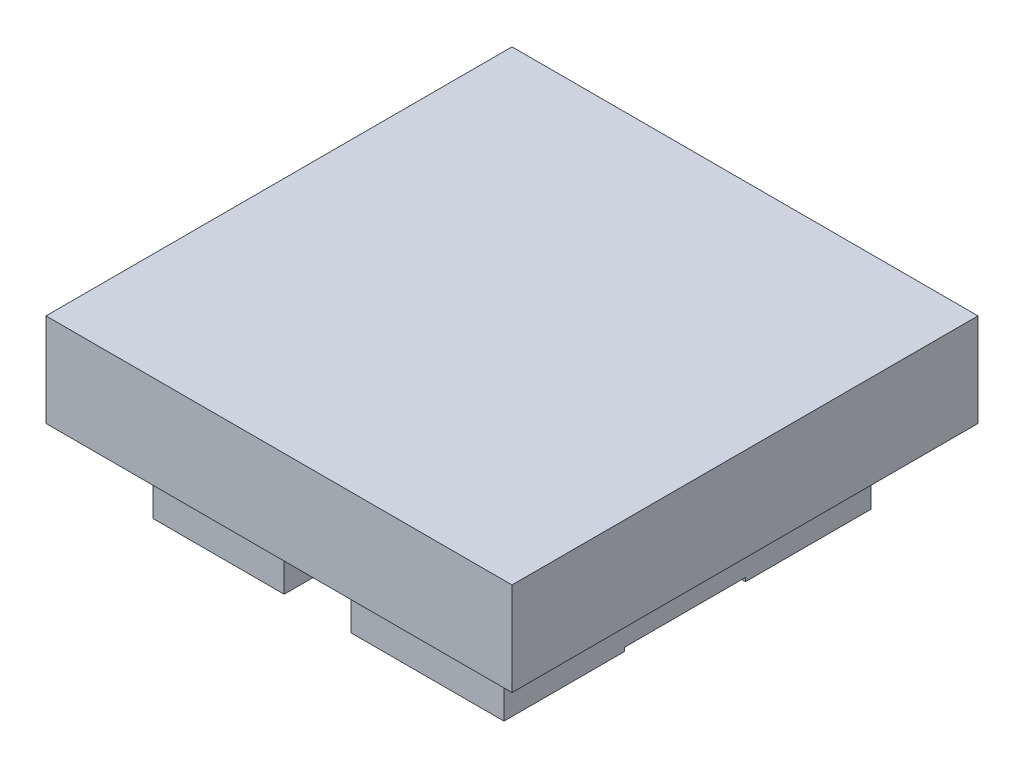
ISO-10303-21;
HEADER;
FILE_DESCRIPTION(('STEP AP214'),'2;1');
FILE_NAME('part.step','',(''),(''),'','','');
FILE_SCHEMA(('AUTOMOTIVE_DESIGN { 1 0 10303 214 1 1 1 1 }'));
ENDSEC;
DATA;
#1=APPLICATION_CONTEXT('core data for automotive mechanical design processes');
#2=APPLICATION_PROTOCOL_DEFINITION('international standard','automotive_design',2000,#1);
#3=PRODUCT_CONTEXT('',#1,'mechanical');
#4=PRODUCT('Part','Part','',(#3));
#5=PRODUCT_RELATED_PRODUCT_CATEGORY('part','',(#4));
#6=PRODUCT_DEFINITION_FORMATION('','',#4);
#7=PRODUCT_DEFINITION_CONTEXT('part definition',#1,'design');
#8=PRODUCT_DEFINITION('design','',#6,#7);
#9=PRODUCT_DEFINITION_SHAPE('','',#8);
#10=(LENGTH_UNIT() NAMED_UNIT(*) SI_UNIT(.MILLI.,.METRE.));
#11=(NAMED_UNIT(*) PLANE_ANGLE_UNIT() SI_UNIT($,.RADIAN.));
#12=(NAMED_UNIT(*) SI_UNIT($,.STERADIAN.) SOLID_ANGLE_UNIT());
#13=UNCERTAINTY_MEASURE_WITH_UNIT(LENGTH_MEASURE(1.E-05),#10,'distance_accuracy_value','');
#14=(GEOMETRIC_REPRESENTATION_CONTEXT(3) GLOBAL_UNCERTAINTY_ASSIGNED_CONTEXT((#13)) GLOBAL_UNIT_ASSIGNED_CONTEXT((#10,
#11,#12)) REPRESENTATION_CONTEXT('',''));
#15=CARTESIAN_POINT('',(0.,0.,0.));
#16=DIRECTION('',(0.,0.,1.));
#17=DIRECTION('',(1.,0.,0.));
#18=AXIS2_PLACEMENT_3D('',#15,#16,#17);
#19=CARTESIAN_POINT('',(0.,-40.,0.));
#20=DIRECTION('',(0.,-1.,0.));
#21=DIRECTION('',(0.,0.,-1.));
#22=AXIS2_PLACEMENT_3D('',#19,#20,#21);
#23=PLANE('',#22);
#24=DIRECTION('',(-1.,0.,0.));
#25=VECTOR('',#24,1.);
#26=CARTESIAN_POINT('',(-73.882719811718,-40.,160.677434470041));
#27=LINE('',#26,#25);
#28=CARTESIAN_POINT('',(103.239295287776,-40.,160.677434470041));
#29=VERTEX_POINT('',#28);
#30=CARTESIAN_POINT('',(32.8965521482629,-40.,160.677434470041));
#31=VERTEX_POINT('',#30);
#32=EDGE_CURVE('E358',#29,#31,#27,.T.);
#33=ORIENTED_EDGE('',*,*,#32,.F.);
#34=DIRECTION('',(0.,0.,1.));
#35=VECTOR('',#34,1.);
#36=CARTESIAN_POINT('',(103.239295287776,-40.,225.453485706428));
#37=LINE('',#36,#35);
#38=CARTESIAN_POINT('',(103.239295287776,-40.,225.453485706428));
#39=VERTEX_POINT('',#38);
#40=EDGE_CURVE('E438',#29,#39,#37,.T.);
#41=ORIENTED_EDGE('',*,*,#40,.T.);
#42=DIRECTION('',(-1.,0.,0.));
#43=VECTOR('',#42,1.);
#44=CARTESIAN_POINT('',(32.8965521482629,-40.,225.453485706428));
#45=LINE('',#44,#43);
#46=CARTESIAN_POINT('',(32.8965521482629,-40.,225.453485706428));
#47=VERTEX_POINT('',#46);
#48=EDGE_CURVE('E442',#39,#47,#45,.T.);
#49=ORIENTED_EDGE('',*,*,#48,.T.);
#50=DIRECTION('',(0.,0.,-1.));
#51=VECTOR('',#50,1.);
#52=CARTESIAN_POINT('',(32.8965521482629,-40.,225.453485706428));
#53=LINE('',#52,#51);
#54=EDGE_CURVE('E432',#47,#31,#53,.T.);
#55=ORIENTED_EDGE('',*,*,#54,.T.);
#56=EDGE_LOOP('',(#33,#41,#49,#55));
#57=FACE_BOUND('',#56,.T.);
#58=ADVANCED_FACE('F33',(#57),#23,.T.);
#59=CARTESIAN_POINT('',(0.,-40.,0.));
#60=DIRECTION('',(0.,-1.,0.));
#61=DIRECTION('',(0.,0.,-1.));
#62=AXIS2_PLACEMENT_3D('',#59,#60,#61);
#63=PLANE('',#62);
#64=DIRECTION('',(0.,0.,-1.));
#65=VECTOR('',#64,1.);
#66=CARTESIAN_POINT('',(151.315270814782,-40.,0.));
#67=LINE('',#66,#65);
#68=CARTESIAN_POINT('',(151.315270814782,-40.,211.789787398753));
#69=VERTEX_POINT('',#68);
#70=CARTESIAN_POINT('',(151.315270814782,-40.,171.304755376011));
#71=VERTEX_POINT('',#70);
#72=EDGE_CURVE('E512',#69,#71,#67,.T.);
#73=ORIENTED_EDGE('',*,*,#72,.F.);
#74=DIRECTION('',(-1.,0.,0.));
#75=VECTOR('',#74,1.);
#76=CARTESIAN_POINT('',(0.,-40.,211.789787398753));
#77=LINE('',#76,#75);
#78=CARTESIAN_POINT('',(209.512504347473,-40.,211.789787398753));
#79=VERTEX_POINT('',#78);
#80=EDGE_CURVE('E509',#79,#69,#77,.T.);
#81=ORIENTED_EDGE('',*,*,#80,.F.);
#82=DIRECTION('',(0.,0.,1.));
#83=VECTOR('',#82,1.);
#84=CARTESIAN_POINT('',(209.512504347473,-40.,0.));
#85=LINE('',#84,#83);
#86=CARTESIAN_POINT('',(209.512504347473,-40.,171.304755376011));
#87=VERTEX_POINT('',#86);
#88=EDGE_CURVE('E506',#87,#79,#85,.T.);
#89=ORIENTED_EDGE('',*,*,#88,.F.);
#90=DIRECTION('',(1.,0.,0.));
#91=VECTOR('',#90,1.);
#92=CARTESIAN_POINT('',(0.,-40.,171.304755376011));
#93=LINE('',#92,#91);
#94=EDGE_CURVE('E503',#71,#87,#93,.T.);
#95=ORIENTED_EDGE('',*,*,#94,.F.);
#96=EDGE_LOOP('',(#73,#81,#89,#95));
#97=FACE_BOUND('',#96,.T.);
#98=DIRECTION('',(-1.,0.,0.));
#99=VECTOR('',#98,1.);
#100=CARTESIAN_POINT('',(0.,-40.,160.677434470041));
#101=LINE('',#100,#99);
#102=CARTESIAN_POINT('',(221.151951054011,-40.,160.677434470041));
#103=VERTEX_POINT('',#102);
#104=CARTESIAN_POINT('',(139.16976120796,-40.,160.677434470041));
#105=VERTEX_POINT('',#104);
#106=EDGE_CURVE('E499',#103,#105,#101,.T.);
#107=ORIENTED_EDGE('',*,*,#106,.F.);
#108=DIRECTION('',(0.,0.,1.));
#109=VECTOR('',#108,1.);
#110=CARTESIAN_POINT('',(221.151951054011,-40.,225.453485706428));
#111=LINE('',#110,#109);
#112=CARTESIAN_POINT('',(221.151951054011,-40.,225.453485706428));
#113=VERTEX_POINT('',#112);
#114=EDGE_CURVE('E402',#103,#113,#111,.T.);
#115=ORIENTED_EDGE('',*,*,#114,.T.);
#116=DIRECTION('',(-1.,0.,0.));
#117=VECTOR('',#116,1.);
#118=CARTESIAN_POINT('',(139.16976120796,-40.,225.453485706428));
#119=LINE('',#118,#117);
#120=CARTESIAN_POINT('',(139.16976120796,-40.,225.453485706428));
#121=VERTEX_POINT('',#120);
#122=EDGE_CURVE('E406',#113,#121,#119,.T.);
#123=ORIENTED_EDGE('',*,*,#122,.T.);
#124=DIRECTION('',(0.,0.,-1.));
#125=VECTOR('',#124,1.);
#126=CARTESIAN_POINT('',(139.16976120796,-40.,225.453485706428));
#127=LINE('',#126,#125);
#128=EDGE_CURVE('E396',#121,#105,#127,.T.);
#129=ORIENTED_EDGE('',*,*,#128,.T.);
#130=EDGE_LOOP('',(#107,#115,#123,#129));
#131=FACE_BOUND('',#130,.T.);
#132=ADVANCED_FACE('F589',(#97,#131),#63,.T.);
#133=CARTESIAN_POINT('',(0.,0.,250.));
#134=DIRECTION('',(0.,1.,0.));
#135=DIRECTION('',(0.,0.,1.));
#136=AXIS2_PLACEMENT_3D('',#133,#134,#135);
#137=PLANE('',#136);
#138=DIRECTION('',(0.,0.,-1.));
#139=VECTOR('',#138,1.);
#140=CARTESIAN_POINT('',(32.8965521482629,0.,225.453485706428));
#141=LINE('',#140,#139);
#142=CARTESIAN_POINT('',(32.8965521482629,0.,225.453485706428));
#143=VERTEX_POINT('',#142);
#144=CARTESIAN_POINT('',(32.8965521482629,0.,28.5950174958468));
#145=VERTEX_POINT('',#144);
#146=EDGE_CURVE('E431',#143,#145,#141,.T.);
#147=ORIENTED_EDGE('',*,*,#146,.F.);
#148=DIRECTION('',(-1.,0.,0.));
#149=VECTOR('',#148,1.);
#150=CARTESIAN_POINT('',(32.8965521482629,0.,225.453485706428));
#151=LINE('',#150,#149);
#152=CARTESIAN_POINT('',(103.239295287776,0.,225.453485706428));
#153=VERTEX_POINT('',#152);
#154=EDGE_CURVE('E453',#153,#143,#151,.T.);
#155=ORIENTED_EDGE('',*,*,#154,.F.);
#156=DIRECTION('',(0.,0.,1.));
#157=VECTOR('',#156,1.);
#158=CARTESIAN_POINT('',(103.239295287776,0.,225.453485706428));
#159=LINE('',#158,#157);
#160=CARTESIAN_POINT('',(103.239295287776,0.,28.5950174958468));
#161=VERTEX_POINT('',#160);
#162=EDGE_CURVE('E450',#161,#153,#159,.T.);
#163=ORIENTED_EDGE('',*,*,#162,.F.);
#164=DIRECTION('',(1.,0.,0.));
#165=VECTOR('',#164,1.);
#166=CARTESIAN_POINT('',(32.8965521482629,0.,28.5950174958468));
#167=LINE('',#166,#165);
#168=EDGE_CURVE('E447',#145,#161,#167,.T.);
#169=ORIENTED_EDGE('',*,*,#168,.F.);
#170=EDGE_LOOP('',(#147,#155,#163,#169));
#171=FACE_BOUND('',#170,.T.);
#172=DIRECTION('',(1.,0.,0.));
#173=VECTOR('',#172,1.);
#174=CARTESIAN_POINT('',(0.,0.,0.));
#175=LINE('',#174,#173);
#176=CARTESIAN_POINT('',(0.,0.,0.));
#177=VERTEX_POINT('',#176);
#178=CARTESIAN_POINT('',(250.,0.,0.));
#179=VERTEX_POINT('',#178);
#180=EDGE_CURVE('E481',#177,#179,#175,.T.);
#181=ORIENTED_EDGE('',*,*,#180,.T.);
#182=DIRECTION('',(0.,0.,-1.));
#183=VECTOR('',#182,1.);
#184=CARTESIAN_POINT('',(250.,0.,250.));
#185=LINE('',#184,#183);
#186=CARTESIAN_POINT('',(250.,0.,250.));
#187=VERTEX_POINT('',#186);
#188=EDGE_CURVE('E491',#187,#179,#185,.T.);
#189=ORIENTED_EDGE('',*,*,#188,.F.);
#190=DIRECTION('',(1.,0.,0.));
#191=VECTOR('',#190,1.);
#192=CARTESIAN_POINT('',(0.,0.,250.));
#193=LINE('',#192,#191);
#194=CARTESIAN_POINT('',(0.,0.,250.));
#195=VERTEX_POINT('',#194);
#196=EDGE_CURVE('E471',#195,#187,#193,.T.);
#197=ORIENTED_EDGE('',*,*,#196,.F.);
#198=DIRECTION('',(0.,0.,-1.));
#199=VECTOR('',#198,1.);
#200=CARTESIAN_POINT('',(0.,0.,250.));
#201=LINE('',#200,#199);
#202=EDGE_CURVE('E494',#195,#177,#201,.T.);
#203=ORIENTED_EDGE('',*,*,#202,.T.);
#204=EDGE_LOOP('',(#181,#189,#197,#203));
#205=FACE_BOUND('',#204,.T.);
#206=DIRECTION('',(0.,0.,-1.));
#207=VECTOR('',#206,1.);
#208=CARTESIAN_POINT('',(139.16976120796,0.,225.453485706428));
#209=LINE('',#208,#207);
#210=CARTESIAN_POINT('',(139.16976120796,0.,225.453485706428));
#211=VERTEX_POINT('',#210);
#212=CARTESIAN_POINT('',(139.16976120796,0.,28.5950174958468));
#213=VERTEX_POINT('',#212);
#214=EDGE_CURVE('E395',#211,#213,#209,.T.);
#215=ORIENTED_EDGE('',*,*,#214,.F.);
#216=DIRECTION('',(-1.,0.,0.));
#217=VECTOR('',#216,1.);
#218=CARTESIAN_POINT('',(139.16976120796,0.,225.453485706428));
#219=LINE('',#218,#217);
#220=CARTESIAN_POINT('',(221.151951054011,0.,225.453485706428));
#221=VERTEX_POINT('',#220);
#222=EDGE_CURVE('E417',#221,#211,#219,.T.);
#223=ORIENTED_EDGE('',*,*,#222,.F.);
#224=DIRECTION('',(0.,0.,1.));
#225=VECTOR('',#224,1.);
#226=CARTESIAN_POINT('',(221.151951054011,0.,225.453485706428));
#227=LINE('',#226,#225);
#228=CARTESIAN_POINT('',(221.151951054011,0.,28.5950174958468));
#229=VERTEX_POINT('',#228);
#230=EDGE_CURVE('E414',#229,#221,#227,.T.);
#231=ORIENTED_EDGE('',*,*,#230,.F.);
#232=DIRECTION('',(1.,0.,0.));
#233=VECTOR('',#232,1.);
#234=CARTESIAN_POINT('',(139.16976120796,0.,28.5950174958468));
#235=LINE('',#234,#233);
#236=EDGE_CURVE('E411',#213,#229,#235,.T.);
#237=ORIENTED_EDGE('',*,*,#236,.F.);
#238=EDGE_LOOP('',(#215,#223,#231,#237));
#239=FACE_BOUND('',#238,.T.);
#240=ADVANCED_FACE('F586',(#171,#205,#239),#137,.F.);
#241=CARTESIAN_POINT('',(0.,0.,250.));
#242=DIRECTION('',(1.,0.,0.));
#243=DIRECTION('',(0.,0.,-1.));
#244=AXIS2_PLACEMENT_3D('',#241,#242,#243);
#245=PLANE('',#244);
#246=DIRECTION('',(0.,-1.,0.));
#247=VECTOR('',#246,1.);
#248=CARTESIAN_POINT('',(0.,0.,0.));
#249=LINE('',#248,#247);
#250=CARTESIAN_POINT('',(0.,50.,0.));
#251=VERTEX_POINT('',#250);
#252=EDGE_CURVE('E467',#251,#177,#249,.T.);
#253=ORIENTED_EDGE('',*,*,#252,.T.);
#254=ORIENTED_EDGE('',*,*,#202,.F.);
#255=DIRECTION('',(0.,-1.,0.));
#256=VECTOR('',#255,1.);
#257=CARTESIAN_POINT('',(0.,0.,250.));
#258=LINE('',#257,#256);
#259=CARTESIAN_POINT('',(0.,50.,250.));
#260=VERTEX_POINT('',#259);
#261=EDGE_CURVE('E468',#260,#195,#258,.T.);
#262=ORIENTED_EDGE('',*,*,#261,.F.);
#263=DIRECTION('',(0.,0.,-1.));
#264=VECTOR('',#263,1.);
#265=CARTESIAN_POINT('',(0.,50.,250.));
#266=LINE('',#265,#264);
#267=EDGE_CURVE('E478',#260,#251,#266,.T.);
#268=ORIENTED_EDGE('',*,*,#267,.T.);
#269=EDGE_LOOP('',(#253,#254,#262,#268));
#270=FACE_BOUND('',#269,.T.);
#271=ADVANCED_FACE('F35',(#270),#245,.F.);
#272=CARTESIAN_POINT('',(250.,0.,250.));
#273=DIRECTION('',(-1.,0.,0.));
#274=DIRECTION('',(0.,0.,1.));
#275=AXIS2_PLACEMENT_3D('',#272,#273,#274);
#276=PLANE('',#275);
#277=DIRECTION('',(0.,1.,0.));
#278=VECTOR('',#277,1.);
#279=CARTESIAN_POINT('',(250.,0.,0.));
#280=LINE('',#279,#278);
#281=CARTESIAN_POINT('',(250.,50.,0.));
#282=VERTEX_POINT('',#281);
#283=EDGE_CURVE('E483',#179,#282,#280,.T.);
#284=ORIENTED_EDGE('',*,*,#283,.T.);
#285=DIRECTION('',(0.,0.,-1.));
#286=VECTOR('',#285,1.);
#287=CARTESIAN_POINT('',(250.,50.,250.));
#288=LINE('',#287,#286);
#289=CARTESIAN_POINT('',(250.,50.,250.));
#290=VERTEX_POINT('',#289);
#291=EDGE_CURVE('E488',#290,#282,#288,.T.);
#292=ORIENTED_EDGE('',*,*,#291,.F.);
#293=DIRECTION('',(0.,1.,0.));
#294=VECTOR('',#293,1.);
#295=CARTESIAN_POINT('',(250.,0.,250.));
#296=LINE('',#295,#294);
#297=EDGE_CURVE('E474',#187,#290,#296,.T.);
#298=ORIENTED_EDGE('',*,*,#297,.F.);
#299=ORIENTED_EDGE('',*,*,#188,.T.);
#300=EDGE_LOOP('',(#284,#292,#298,#299));
#301=FACE_BOUND('',#300,.T.);
#302=ADVANCED_FACE('F668',(#301),#276,.F.);
#303=CARTESIAN_POINT('',(0.,50.,250.));
#304=DIRECTION('',(0.,-1.,0.));
#305=DIRECTION('',(0.,0.,-1.));
#306=AXIS2_PLACEMENT_3D('',#303,#304,#305);
#307=PLANE('',#306);
#308=DIRECTION('',(-1.,0.,0.));
#309=VECTOR('',#308,1.);
#310=CARTESIAN_POINT('',(0.,50.,0.));
#311=LINE('',#310,#309);
#312=EDGE_CURVE('E472',#282,#251,#311,.T.);
#313=ORIENTED_EDGE('',*,*,#312,.T.);
#314=ORIENTED_EDGE('',*,*,#267,.F.);
#315=DIRECTION('',(-1.,0.,0.));
#316=VECTOR('',#315,1.);
#317=CARTESIAN_POINT('',(0.,50.,250.));
#318=LINE('',#317,#316);
#319=EDGE_CURVE('E476',#290,#260,#318,.T.);
#320=ORIENTED_EDGE('',*,*,#319,.F.);
#321=ORIENTED_EDGE('',*,*,#291,.T.);
#322=EDGE_LOOP('',(#313,#314,#320,#321));
#323=FACE_BOUND('',#322,.T.);
#324=ADVANCED_FACE('F661',(#323),#307,.F.);
#325=CARTESIAN_POINT('',(0.,0.,250.));
#326=DIRECTION('',(0.,0.,-1.));
#327=DIRECTION('',(-1.,0.,0.));
#328=AXIS2_PLACEMENT_3D('',#325,#326,#327);
#329=PLANE('',#328);
#330=ORIENTED_EDGE('',*,*,#261,.T.);
#331=ORIENTED_EDGE('',*,*,#196,.T.);
#332=ORIENTED_EDGE('',*,*,#297,.T.);
#333=ORIENTED_EDGE('',*,*,#319,.T.);
#334=EDGE_LOOP('',(#330,#331,#332,#333));
#335=FACE_BOUND('',#334,.T.);
#336=ADVANCED_FACE('F658',(#335),#329,.F.);
#337=CARTESIAN_POINT('',(0.,0.,0.));
#338=DIRECTION('',(0.,0.,-1.));
#339=DIRECTION('',(-1.,0.,0.));
#340=AXIS2_PLACEMENT_3D('',#337,#338,#339);
#341=PLANE('',#340);
#342=ORIENTED_EDGE('',*,*,#252,.F.);
#343=ORIENTED_EDGE('',*,*,#312,.F.);
#344=ORIENTED_EDGE('',*,*,#283,.F.);
#345=ORIENTED_EDGE('',*,*,#180,.F.);
#346=EDGE_LOOP('',(#342,#343,#344,#345));
#347=FACE_BOUND('',#346,.T.);
#348=ADVANCED_FACE('F657',(#347),#341,.T.);
#349=CARTESIAN_POINT('',(32.8965521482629,-40.,225.453485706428));
#350=DIRECTION('',(1.,0.,0.));
#351=DIRECTION('',(0.,0.,-1.));
#352=AXIS2_PLACEMENT_3D('',#349,#350,#351);
#353=PLANE('',#352);
#354=DIRECTION('',(0.,0.,-1.));
#355=VECTOR('',#354,1.);
#356=CARTESIAN_POINT('',(32.8965521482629,-38.,225.453485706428));
#357=LINE('',#356,#355);
#358=CARTESIAN_POINT('',(32.8965521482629,-38.,160.677434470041));
#359=VERTEX_POINT('',#358);
#360=CARTESIAN_POINT('',(32.8965521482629,-38.,95.9013832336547));
#361=VERTEX_POINT('',#360);
#362=EDGE_CURVE('E393',#359,#361,#357,.T.);
#363=ORIENTED_EDGE('',*,*,#362,.F.);
#364=DIRECTION('',(0.,-1.,0.));
#365=VECTOR('',#364,1.);
#366=CARTESIAN_POINT('',(32.8965521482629,-40.,160.677434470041));
#367=LINE('',#366,#365);
#368=EDGE_CURVE('E386',#359,#31,#367,.T.);
#369=ORIENTED_EDGE('',*,*,#368,.T.);
#370=ORIENTED_EDGE('',*,*,#54,.F.);
#371=DIRECTION('',(0.,1.,0.));
#372=VECTOR('',#371,1.);
#373=CARTESIAN_POINT('',(32.8965521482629,-40.,225.453485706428));
#374=LINE('',#373,#372);
#375=EDGE_CURVE('E444',#47,#143,#374,.T.);
#376=ORIENTED_EDGE('',*,*,#375,.T.);
#377=ORIENTED_EDGE('',*,*,#146,.T.);
#378=DIRECTION('',(0.,1.,0.));
#379=VECTOR('',#378,1.);
#380=CARTESIAN_POINT('',(32.8965521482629,-40.,28.5950174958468));
#381=LINE('',#380,#379);
#382=CARTESIAN_POINT('',(32.8965521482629,-40.,28.5950174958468));
#383=VERTEX_POINT('',#382);
#384=EDGE_CURVE('E464',#383,#145,#381,.T.);
#385=ORIENTED_EDGE('',*,*,#384,.F.);
#386=CARTESIAN_POINT('',(32.8965521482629,-40.,95.9013832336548));
#387=VERTEX_POINT('',#386);
#388=EDGE_CURVE('E436',#387,#383,#53,.T.);
#389=ORIENTED_EDGE('',*,*,#388,.F.);
#390=DIRECTION('',(0.,1.,0.));
#391=VECTOR('',#390,1.);
#392=CARTESIAN_POINT('',(32.8965521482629,-40.,95.9013832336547));
#393=LINE('',#392,#391);
#394=EDGE_CURVE('E374',#387,#361,#393,.T.);
#395=ORIENTED_EDGE('',*,*,#394,.T.);
#396=EDGE_LOOP('',(#363,#369,#370,#376,#377,#385,#389,#395));
#397=FACE_BOUND('',#396,.T.);
#398=ADVANCED_FACE('F564',(#397),#353,.F.);
#399=CARTESIAN_POINT('',(32.8965521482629,-40.,28.5950174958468));
#400=DIRECTION('',(0.,0.,1.));
#401=DIRECTION('',(1.,0.,0.));
#402=AXIS2_PLACEMENT_3D('',#399,#400,#401);
#403=PLANE('',#402);
#404=ORIENTED_EDGE('',*,*,#168,.T.);
#405=DIRECTION('',(0.,1.,0.));
#406=VECTOR('',#405,1.);
#407=CARTESIAN_POINT('',(103.239295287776,-40.,28.5950174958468));
#408=LINE('',#407,#406);
#409=CARTESIAN_POINT('',(103.239295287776,-40.,28.5950174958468));
#410=VERTEX_POINT('',#409);
#411=EDGE_CURVE('E461',#410,#161,#408,.T.);
#412=ORIENTED_EDGE('',*,*,#411,.F.);
#413=DIRECTION('',(1.,0.,0.));
#414=VECTOR('',#413,1.);
#415=CARTESIAN_POINT('',(32.8965521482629,-40.,28.5950174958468));
#416=LINE('',#415,#414);
#417=EDGE_CURVE('E435',#383,#410,#416,.T.);
#418=ORIENTED_EDGE('',*,*,#417,.F.);
#419=ORIENTED_EDGE('',*,*,#384,.T.);
#420=EDGE_LOOP('',(#404,#412,#418,#419));
#421=FACE_BOUND('',#420,.T.);
#422=ADVANCED_FACE('F571',(#421),#403,.F.);
#423=CARTESIAN_POINT('',(103.239295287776,-40.,225.453485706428));
#424=DIRECTION('',(-1.,0.,0.));
#425=DIRECTION('',(0.,0.,1.));
#426=AXIS2_PLACEMENT_3D('',#423,#424,#425);
#427=PLANE('',#426);
#428=ORIENTED_EDGE('',*,*,#40,.F.);
#429=DIRECTION('',(0.,1.,0.));
#430=VECTOR('',#429,1.);
#431=CARTESIAN_POINT('',(103.239295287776,-40.,160.677434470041));
#432=LINE('',#431,#430);
#433=CARTESIAN_POINT('',(103.239295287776,-38.,160.677434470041));
#434=VERTEX_POINT('',#433);
#435=EDGE_CURVE('E383',#29,#434,#432,.T.);
#436=ORIENTED_EDGE('',*,*,#435,.T.);
#437=DIRECTION('',(0.,0.,1.));
#438=VECTOR('',#437,1.);
#439=CARTESIAN_POINT('',(103.239295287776,-38.,225.453485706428));
#440=LINE('',#439,#438);
#441=CARTESIAN_POINT('',(103.239295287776,-38.,95.9013832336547));
#442=VERTEX_POINT('',#441);
#443=EDGE_CURVE('E391',#442,#434,#440,.T.);
#444=ORIENTED_EDGE('',*,*,#443,.F.);
#445=DIRECTION('',(0.,-1.,0.));
#446=VECTOR('',#445,1.);
#447=CARTESIAN_POINT('',(103.239295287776,-40.,95.9013832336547));
#448=LINE('',#447,#446);
#449=CARTESIAN_POINT('',(103.239295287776,-40.,95.9013832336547));
#450=VERTEX_POINT('',#449);
#451=EDGE_CURVE('E371',#442,#450,#448,.T.);
#452=ORIENTED_EDGE('',*,*,#451,.T.);
#453=EDGE_CURVE('E439',#410,#450,#37,.T.);
#454=ORIENTED_EDGE('',*,*,#453,.F.);
#455=ORIENTED_EDGE('',*,*,#411,.T.);
#456=ORIENTED_EDGE('',*,*,#162,.T.);
#457=DIRECTION('',(0.,1.,0.));
#458=VECTOR('',#457,1.);
#459=CARTESIAN_POINT('',(103.239295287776,-40.,225.453485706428));
#460=LINE('',#459,#458);
#461=EDGE_CURVE('E458',#39,#153,#460,.T.);
#462=ORIENTED_EDGE('',*,*,#461,.F.);
#463=EDGE_LOOP('',(#428,#436,#444,#452,#454,#455,#456,#462));
#464=FACE_BOUND('',#463,.T.);
#465=ADVANCED_FACE('F575',(#464),#427,.F.);
#466=CARTESIAN_POINT('',(32.8965521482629,-40.,225.453485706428));
#467=DIRECTION('',(0.,0.,-1.));
#468=DIRECTION('',(-1.,0.,0.));
#469=AXIS2_PLACEMENT_3D('',#466,#467,#468);
#470=PLANE('',#469);
#471=ORIENTED_EDGE('',*,*,#154,.T.);
#472=ORIENTED_EDGE('',*,*,#375,.F.);
#473=ORIENTED_EDGE('',*,*,#48,.F.);
#474=ORIENTED_EDGE('',*,*,#461,.T.);
#475=EDGE_LOOP('',(#471,#472,#473,#474));
#476=FACE_BOUND('',#475,.T.);
#477=ADVANCED_FACE('F584',(#476),#470,.F.);
#478=DIRECTION('',(1.,0.,0.));
#479=VECTOR('',#478,1.);
#480=CARTESIAN_POINT('',(-73.882719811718,-40.,95.9013832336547));
#481=LINE('',#480,#479);
#482=EDGE_CURVE('E348',#387,#450,#481,.T.);
#483=ORIENTED_EDGE('',*,*,#482,.F.);
#484=ORIENTED_EDGE('',*,*,#388,.T.);
#485=ORIENTED_EDGE('',*,*,#417,.T.);
#486=ORIENTED_EDGE('',*,*,#453,.T.);
#487=EDGE_LOOP('',(#483,#484,#485,#486));
#488=FACE_BOUND('',#487,.T.);
#489=ADVANCED_FACE('F568',(#488),#23,.T.);
#490=CARTESIAN_POINT('',(139.16976120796,-40.,225.453485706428));
#491=DIRECTION('',(1.,0.,0.));
#492=DIRECTION('',(0.,0.,-1.));
#493=AXIS2_PLACEMENT_3D('',#490,#491,#492);
#494=PLANE('',#493);
#495=DIRECTION('',(0.,0.,-1.));
#496=VECTOR('',#495,1.);
#497=CARTESIAN_POINT('',(139.16976120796,-38.,225.453485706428));
#498=LINE('',#497,#496);
#499=CARTESIAN_POINT('',(139.16976120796,-38.,160.677434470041));
#500=VERTEX_POINT('',#499);
#501=CARTESIAN_POINT('',(139.16976120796,-38.,95.9013832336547));
#502=VERTEX_POINT('',#501);
#503=EDGE_CURVE('E389',#500,#502,#498,.T.);
#504=ORIENTED_EDGE('',*,*,#503,.F.);
#505=DIRECTION('',(0.,-1.,0.));
#506=VECTOR('',#505,1.);
#507=CARTESIAN_POINT('',(139.16976120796,-40.,160.677434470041));
#508=LINE('',#507,#506);
#509=EDGE_CURVE('E380',#500,#105,#508,.T.);
#510=ORIENTED_EDGE('',*,*,#509,.T.);
#511=ORIENTED_EDGE('',*,*,#128,.F.);
#512=DIRECTION('',(0.,1.,0.));
#513=VECTOR('',#512,1.);
#514=CARTESIAN_POINT('',(139.16976120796,-40.,225.453485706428));
#515=LINE('',#514,#513);
#516=EDGE_CURVE('E408',#121,#211,#515,.T.);
#517=ORIENTED_EDGE('',*,*,#516,.T.);
#518=ORIENTED_EDGE('',*,*,#214,.T.);
#519=DIRECTION('',(0.,1.,0.));
#520=VECTOR('',#519,1.);
#521=CARTESIAN_POINT('',(139.16976120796,-40.,28.5950174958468));
#522=LINE('',#521,#520);
#523=CARTESIAN_POINT('',(139.16976120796,-40.,28.5950174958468));
#524=VERTEX_POINT('',#523);
#525=EDGE_CURVE('E428',#524,#213,#522,.T.);
#526=ORIENTED_EDGE('',*,*,#525,.F.);
#527=CARTESIAN_POINT('',(139.16976120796,-40.,95.9013832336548));
#528=VERTEX_POINT('',#527);
#529=EDGE_CURVE('E400',#528,#524,#127,.T.);
#530=ORIENTED_EDGE('',*,*,#529,.F.);
#531=DIRECTION('',(0.,1.,0.));
#532=VECTOR('',#531,1.);
#533=CARTESIAN_POINT('',(139.16976120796,-40.,95.9013832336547));
#534=LINE('',#533,#532);
#535=EDGE_CURVE('E368',#528,#502,#534,.T.);
#536=ORIENTED_EDGE('',*,*,#535,.T.);
#537=EDGE_LOOP('',(#504,#510,#511,#517,#518,#526,#530,#536));
#538=FACE_BOUND('',#537,.T.);
#539=ADVANCED_FACE('F601',(#538),#494,.F.);
#540=CARTESIAN_POINT('',(139.16976120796,-40.,28.5950174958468));
#541=DIRECTION('',(0.,0.,1.));
#542=DIRECTION('',(1.,0.,0.));
#543=AXIS2_PLACEMENT_3D('',#540,#541,#542);
#544=PLANE('',#543);
#545=ORIENTED_EDGE('',*,*,#236,.T.);
#546=DIRECTION('',(0.,1.,0.));
#547=VECTOR('',#546,1.);
#548=CARTESIAN_POINT('',(221.151951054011,-40.,28.5950174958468));
#549=LINE('',#548,#547);
#550=CARTESIAN_POINT('',(221.151951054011,-40.,28.5950174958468));
#551=VERTEX_POINT('',#550);
#552=EDGE_CURVE('E425',#551,#229,#549,.T.);
#553=ORIENTED_EDGE('',*,*,#552,.F.);
#554=DIRECTION('',(1.,0.,0.));
#555=VECTOR('',#554,1.);
#556=CARTESIAN_POINT('',(139.16976120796,-40.,28.5950174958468));
#557=LINE('',#556,#555);
#558=EDGE_CURVE('E399',#524,#551,#557,.T.);
#559=ORIENTED_EDGE('',*,*,#558,.F.);
#560=ORIENTED_EDGE('',*,*,#525,.T.);
#561=EDGE_LOOP('',(#545,#553,#559,#560));
#562=FACE_BOUND('',#561,.T.);
#563=ADVANCED_FACE('F610',(#562),#544,.F.);
#564=CARTESIAN_POINT('',(221.151951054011,-40.,225.453485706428));
#565=DIRECTION('',(-1.,0.,0.));
#566=DIRECTION('',(0.,0.,1.));
#567=AXIS2_PLACEMENT_3D('',#564,#565,#566);
#568=PLANE('',#567);
#569=ORIENTED_EDGE('',*,*,#114,.F.);
#570=DIRECTION('',(0.,1.,0.));
#571=VECTOR('',#570,1.);
#572=CARTESIAN_POINT('',(221.151951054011,-40.,160.677434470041));
#573=LINE('',#572,#571);
#574=CARTESIAN_POINT('',(221.151951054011,-38.,160.677434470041));
#575=VERTEX_POINT('',#574);
#576=EDGE_CURVE('E377',#103,#575,#573,.T.);
#577=ORIENTED_EDGE('',*,*,#576,.T.);
#578=DIRECTION('',(0.,0.,1.));
#579=VECTOR('',#578,1.);
#580=CARTESIAN_POINT('',(221.151951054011,-38.,225.453485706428));
#581=LINE('',#580,#579);
#582=CARTESIAN_POINT('',(221.151951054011,-38.,95.9013832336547));
#583=VERTEX_POINT('',#582);
#584=EDGE_CURVE('E501',#583,#575,#581,.T.);
#585=ORIENTED_EDGE('',*,*,#584,.F.);
#586=DIRECTION('',(0.,-1.,0.));
#587=VECTOR('',#586,1.);
#588=CARTESIAN_POINT('',(221.151951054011,-40.,95.9013832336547));
#589=LINE('',#588,#587);
#590=CARTESIAN_POINT('',(221.151951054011,-40.,95.9013832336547));
#591=VERTEX_POINT('',#590);
#592=EDGE_CURVE('E365',#583,#591,#589,.T.);
#593=ORIENTED_EDGE('',*,*,#592,.T.);
#594=EDGE_CURVE('E403',#551,#591,#111,.T.);
#595=ORIENTED_EDGE('',*,*,#594,.F.);
#596=ORIENTED_EDGE('',*,*,#552,.T.);
#597=ORIENTED_EDGE('',*,*,#230,.T.);
#598=DIRECTION('',(0.,1.,0.));
#599=VECTOR('',#598,1.);
#600=CARTESIAN_POINT('',(221.151951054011,-40.,225.453485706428));
#601=LINE('',#600,#599);
#602=EDGE_CURVE('E422',#113,#221,#601,.T.);
#603=ORIENTED_EDGE('',*,*,#602,.F.);
#604=EDGE_LOOP('',(#569,#577,#585,#593,#595,#596,#597,#603));
#605=FACE_BOUND('',#604,.T.);
#606=ADVANCED_FACE('F606',(#605),#568,.F.);
#607=CARTESIAN_POINT('',(139.16976120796,-40.,225.453485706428));
#608=DIRECTION('',(0.,0.,-1.));
#609=DIRECTION('',(-1.,0.,0.));
#610=AXIS2_PLACEMENT_3D('',#607,#608,#609);
#611=PLANE('',#610);
#612=ORIENTED_EDGE('',*,*,#222,.T.);
#613=ORIENTED_EDGE('',*,*,#516,.F.);
#614=ORIENTED_EDGE('',*,*,#122,.F.);
#615=ORIENTED_EDGE('',*,*,#602,.T.);
#616=EDGE_LOOP('',(#612,#613,#614,#615));
#617=FACE_BOUND('',#616,.T.);
#618=ADVANCED_FACE('F596',(#617),#611,.F.);
#619=DIRECTION('',(1.,0.,0.));
#620=VECTOR('',#619,1.);
#621=CARTESIAN_POINT('',(0.,-40.,95.9013832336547));
#622=LINE('',#621,#620);
#623=EDGE_CURVE('E497',#528,#591,#622,.T.);
#624=ORIENTED_EDGE('',*,*,#623,.F.);
#625=ORIENTED_EDGE('',*,*,#529,.T.);
#626=ORIENTED_EDGE('',*,*,#558,.T.);
#627=ORIENTED_EDGE('',*,*,#594,.T.);
#628=EDGE_LOOP('',(#624,#625,#626,#627));
#629=FACE_BOUND('',#628,.T.);
#630=ADVANCED_FACE('F615',(#629),#63,.T.);
#631=CARTESIAN_POINT('',(-73.882719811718,-38.,95.9013832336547));
#632=DIRECTION('',(0.,0.,-1.));
#633=DIRECTION('',(-1.,0.,0.));
#634=AXIS2_PLACEMENT_3D('',#631,#632,#633);
#635=PLANE('',#634);
#636=ORIENTED_EDGE('',*,*,#623,.T.);
#637=ORIENTED_EDGE('',*,*,#592,.F.);
#638=DIRECTION('',(1.,0.,0.));
#639=VECTOR('',#638,1.);
#640=CARTESIAN_POINT('',(-73.882719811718,-38.,95.9013832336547));
#641=LINE('',#640,#639);
#642=EDGE_CURVE('E354',#502,#583,#641,.T.);
#643=ORIENTED_EDGE('',*,*,#642,.F.);
#644=ORIENTED_EDGE('',*,*,#535,.F.);
#645=EDGE_LOOP('',(#636,#637,#643,#644));
#646=FACE_BOUND('',#645,.T.);
#647=ADVANCED_FACE('F617',(#646),#635,.F.);
#648=CARTESIAN_POINT('',(-73.882719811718,-38.,160.677434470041));
#649=DIRECTION('',(0.,0.,1.));
#650=DIRECTION('',(1.,0.,0.));
#651=AXIS2_PLACEMENT_3D('',#648,#649,#650);
#652=PLANE('',#651);
#653=DIRECTION('',(-1.,0.,0.));
#654=VECTOR('',#653,1.);
#655=CARTESIAN_POINT('',(-73.882719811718,-38.,160.677434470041));
#656=LINE('',#655,#654);
#657=EDGE_CURVE('E362',#575,#500,#656,.T.);
#658=ORIENTED_EDGE('',*,*,#657,.F.);
#659=ORIENTED_EDGE('',*,*,#576,.F.);
#660=ORIENTED_EDGE('',*,*,#106,.T.);
#661=ORIENTED_EDGE('',*,*,#509,.F.);
#662=EDGE_LOOP('',(#658,#659,#660,#661));
#663=FACE_BOUND('',#662,.T.);
#664=ADVANCED_FACE('F624',(#663),#652,.F.);
#665=CARTESIAN_POINT('',(0.,-38.,0.));
#666=DIRECTION('',(0.,-1.,0.));
#667=DIRECTION('',(0.,0.,-1.));
#668=AXIS2_PLACEMENT_3D('',#665,#666,#667);
#669=PLANE('',#668);
#670=DIRECTION('',(0.,0.,-1.));
#671=VECTOR('',#670,1.);
#672=CARTESIAN_POINT('',(200.90943504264,-38.,0.));
#673=LINE('',#672,#671);
#674=CARTESIAN_POINT('',(200.90943504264,-38.,153.592553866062));
#675=VERTEX_POINT('',#674);
#676=CARTESIAN_POINT('',(200.90943504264,-38.,136.892478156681));
#677=VERTEX_POINT('',#676);
#678=EDGE_CURVE('E524',#675,#677,#673,.T.);
#679=ORIENTED_EDGE('',*,*,#678,.F.);
#680=DIRECTION('',(-1.,0.,0.));
#681=VECTOR('',#680,1.);
#682=CARTESIAN_POINT('',(0.,-38.,153.592553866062));
#683=LINE('',#682,#681);
#684=CARTESIAN_POINT('',(209.512504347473,-38.,153.592553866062));
#685=VERTEX_POINT('',#684);
#686=EDGE_CURVE('E521',#685,#675,#683,.T.);
#687=ORIENTED_EDGE('',*,*,#686,.F.);
#688=DIRECTION('',(0.,0.,1.));
#689=VECTOR('',#688,1.);
#690=CARTESIAN_POINT('',(209.512504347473,-38.,0.));
#691=LINE('',#690,#689);
#692=CARTESIAN_POINT('',(209.512504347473,-38.,136.892478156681));
#693=VERTEX_POINT('',#692);
#694=EDGE_CURVE('E518',#693,#685,#691,.T.);
#695=ORIENTED_EDGE('',*,*,#694,.F.);
#696=DIRECTION('',(1.,0.,0.));
#697=VECTOR('',#696,1.);
#698=CARTESIAN_POINT('',(0.,-38.,136.892478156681));
#699=LINE('',#698,#697);
#700=EDGE_CURVE('E515',#677,#693,#699,.T.);
#701=ORIENTED_EDGE('',*,*,#700,.F.);
#702=EDGE_LOOP('',(#679,#687,#695,#701));
#703=FACE_BOUND('',#702,.T.);
#704=ORIENTED_EDGE('',*,*,#503,.T.);
#705=ORIENTED_EDGE('',*,*,#642,.T.);
#706=ORIENTED_EDGE('',*,*,#584,.T.);
#707=ORIENTED_EDGE('',*,*,#657,.T.);
#708=EDGE_LOOP('',(#704,#705,#706,#707));
#709=FACE_BOUND('',#708,.T.);
#710=ADVANCED_FACE('F551',(#703,#709),#669,.T.);
#711=DIRECTION('',(0.,0.,-1.));
#712=VECTOR('',#711,1.);
#713=CARTESIAN_POINT('',(56.6815084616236,-38.,0.));
#714=LINE('',#713,#712);
#715=CARTESIAN_POINT('',(56.6815084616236,-38.,132.337912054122));
#716=VERTEX_POINT('',#715);
#717=CARTESIAN_POINT('',(56.6815084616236,-38.,122.722716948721));
#718=VERTEX_POINT('',#717);
#719=EDGE_CURVE('E11',#716,#718,#714,.T.);
#720=ORIENTED_EDGE('',*,*,#719,.F.);
#721=DIRECTION('',(-1.,0.,0.));
#722=VECTOR('',#721,1.);
#723=CARTESIAN_POINT('',(0.,-38.,132.337912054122));
#724=LINE('',#723,#722);
#725=CARTESIAN_POINT('',(81.4785905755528,-38.,132.337912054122));
#726=VERTEX_POINT('',#725);
#727=EDGE_CURVE('E41',#726,#716,#724,.T.);
#728=ORIENTED_EDGE('',*,*,#727,.F.);
#729=DIRECTION('',(0.,0.,1.));
#730=VECTOR('',#729,1.);
#731=CARTESIAN_POINT('',(81.4785905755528,-38.,0.));
#732=LINE('',#731,#730);
#733=CARTESIAN_POINT('',(81.4785905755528,-38.,122.722716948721));
#734=VERTEX_POINT('',#733);
#735=EDGE_CURVE('E541',#734,#726,#732,.T.);
#736=ORIENTED_EDGE('',*,*,#735,.F.);
#737=DIRECTION('',(1.,0.,0.));
#738=VECTOR('',#737,1.);
#739=CARTESIAN_POINT('',(0.,-38.,122.722716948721));
#740=LINE('',#739,#738);
#741=EDGE_CURVE('E539',#718,#734,#740,.T.);
#742=ORIENTED_EDGE('',*,*,#741,.F.);
#743=EDGE_LOOP('',(#720,#728,#736,#742));
#744=FACE_BOUND('',#743,.T.);
#745=DIRECTION('',(0.,0.,-1.));
#746=VECTOR('',#745,1.);
#747=CARTESIAN_POINT('',(56.6815084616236,-38.,0.));
#748=LINE('',#747,#746);
#749=CARTESIAN_POINT('',(56.6815084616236,-38.,145.242516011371));
#750=VERTEX_POINT('',#749);
#751=CARTESIAN_POINT('',(56.6815084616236,-38.,136.892478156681));
#752=VERTEX_POINT('',#751);
#753=EDGE_CURVE('E536',#750,#752,#748,.T.);
#754=ORIENTED_EDGE('',*,*,#753,.F.);
#755=DIRECTION('',(-1.,0.,0.));
#756=VECTOR('',#755,1.);
#757=CARTESIAN_POINT('',(0.,-38.,145.242516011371));
#758=LINE('',#757,#756);
#759=CARTESIAN_POINT('',(81.4785905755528,-38.,145.242516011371));
#760=VERTEX_POINT('',#759);
#761=EDGE_CURVE('E533',#760,#750,#758,.T.);
#762=ORIENTED_EDGE('',*,*,#761,.F.);
#763=DIRECTION('',(0.,0.,1.));
#764=VECTOR('',#763,1.);
#765=CARTESIAN_POINT('',(81.4785905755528,-38.,0.));
#766=LINE('',#765,#764);
#767=CARTESIAN_POINT('',(81.4785905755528,-38.,136.892478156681));
#768=VERTEX_POINT('',#767);
#769=EDGE_CURVE('E530',#768,#760,#766,.T.);
#770=ORIENTED_EDGE('',*,*,#769,.F.);
#771=DIRECTION('',(1.,0.,0.));
#772=VECTOR('',#771,1.);
#773=CARTESIAN_POINT('',(0.,-38.,136.892478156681));
#774=LINE('',#773,#772);
#775=EDGE_CURVE('E527',#752,#768,#774,.T.);
#776=ORIENTED_EDGE('',*,*,#775,.F.);
#777=EDGE_LOOP('',(#754,#762,#770,#776));
#778=FACE_BOUND('',#777,.T.);
#779=ORIENTED_EDGE('',*,*,#362,.T.);
#780=EDGE_CURVE('E357',#361,#442,#641,.T.);
#781=ORIENTED_EDGE('',*,*,#780,.T.);
#782=ORIENTED_EDGE('',*,*,#443,.T.);
#783=EDGE_CURVE('E359',#434,#359,#656,.T.);
#784=ORIENTED_EDGE('',*,*,#783,.T.);
#785=EDGE_LOOP('',(#779,#781,#782,#784));
#786=FACE_BOUND('',#785,.T.);
#787=ADVANCED_FACE('F547',(#744,#778,#786),#669,.T.);
#788=ORIENTED_EDGE('',*,*,#783,.F.);
#789=ORIENTED_EDGE('',*,*,#435,.F.);
#790=ORIENTED_EDGE('',*,*,#32,.T.);
#791=ORIENTED_EDGE('',*,*,#368,.F.);
#792=EDGE_LOOP('',(#788,#789,#790,#791));
#793=FACE_BOUND('',#792,.T.);
#794=ADVANCED_FACE('F550',(#793),#652,.F.);
#795=ORIENTED_EDGE('',*,*,#482,.T.);
#796=ORIENTED_EDGE('',*,*,#451,.F.);
#797=ORIENTED_EDGE('',*,*,#780,.F.);
#798=ORIENTED_EDGE('',*,*,#394,.F.);
#799=EDGE_LOOP('',(#795,#796,#797,#798));
#800=FACE_BOUND('',#799,.T.);
#801=ADVANCED_FACE('F561',(#800),#635,.F.);
#802=CARTESIAN_POINT('',(151.315270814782,-28.,211.789787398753));
#803=DIRECTION('',(-1.,0.,0.));
#804=DIRECTION('',(0.,0.,1.));
#805=AXIS2_PLACEMENT_3D('',#802,#803,#804);
#806=PLANE('',#805);
#807=DIRECTION('',(0.,-1.,0.));
#808=VECTOR('',#807,1.);
#809=CARTESIAN_POINT('',(151.315270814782,-28.,211.789787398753));
#810=LINE('',#809,#808);
#811=CARTESIAN_POINT('',(151.315270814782,-41.,211.789787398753));
#812=VERTEX_POINT('',#811);
#813=EDGE_CURVE('E346',#69,#812,#810,.T.);
#814=ORIENTED_EDGE('',*,*,#813,.F.);
#815=ORIENTED_EDGE('',*,*,#72,.T.);
#816=DIRECTION('',(0.,-1.,0.));
#817=VECTOR('',#816,1.);
#818=CARTESIAN_POINT('',(151.315270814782,-28.,171.304755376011));
#819=LINE('',#818,#817);
#820=CARTESIAN_POINT('',(151.315270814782,-41.,171.304755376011));
#821=VERTEX_POINT('',#820);
#822=EDGE_CURVE('E345',#71,#821,#819,.T.);
#823=ORIENTED_EDGE('',*,*,#822,.T.);
#824=DIRECTION('',(0.,0.,-1.));
#825=VECTOR('',#824,1.);
#826=CARTESIAN_POINT('',(151.315270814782,-41.,211.789787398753));
#827=LINE('',#826,#825);
#828=EDGE_CURVE('E328',#812,#821,#827,.T.);
#829=ORIENTED_EDGE('',*,*,#828,.F.);
#830=EDGE_LOOP('',(#814,#815,#823,#829));
#831=FACE_BOUND('',#830,.T.);
#832=ADVANCED_FACE('F723',(#831),#806,.T.);
#833=CARTESIAN_POINT('',(151.315270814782,-28.,211.789787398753));
#834=DIRECTION('',(0.,0.,1.));
#835=DIRECTION('',(1.,0.,0.));
#836=AXIS2_PLACEMENT_3D('',#833,#834,#835);
#837=PLANE('',#836);
#838=DIRECTION('',(0.,-1.,0.));
#839=VECTOR('',#838,1.);
#840=CARTESIAN_POINT('',(209.512504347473,-28.,211.789787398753));
#841=LINE('',#840,#839);
#842=CARTESIAN_POINT('',(209.512504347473,-41.,211.789787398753));
#843=VERTEX_POINT('',#842);
#844=EDGE_CURVE('E349',#79,#843,#841,.T.);
#845=ORIENTED_EDGE('',*,*,#844,.F.);
#846=ORIENTED_EDGE('',*,*,#80,.T.);
#847=ORIENTED_EDGE('',*,*,#813,.T.);
#848=DIRECTION('',(-1.,0.,0.));
#849=VECTOR('',#848,1.);
#850=CARTESIAN_POINT('',(151.315270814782,-41.,211.789787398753));
#851=LINE('',#850,#849);
#852=EDGE_CURVE('E342',#843,#812,#851,.T.);
#853=ORIENTED_EDGE('',*,*,#852,.F.);
#854=EDGE_LOOP('',(#845,#846,#847,#853));
#855=FACE_BOUND('',#854,.T.);
#856=ADVANCED_FACE('F728',(#855),#837,.T.);
#857=CARTESIAN_POINT('',(209.512504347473,-28.,211.789787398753));
#858=DIRECTION('',(1.,0.,0.));
#859=DIRECTION('',(0.,0.,-1.));
#860=AXIS2_PLACEMENT_3D('',#857,#858,#859);
#861=PLANE('',#860);
#862=DIRECTION('',(0.,-1.,0.));
#863=VECTOR('',#862,1.);
#864=CARTESIAN_POINT('',(209.512504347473,-28.,171.304755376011));
#865=LINE('',#864,#863);
#866=CARTESIAN_POINT('',(209.512504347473,-41.,171.304755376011));
#867=VERTEX_POINT('',#866);
#868=EDGE_CURVE('E351',#87,#867,#865,.T.);
#869=ORIENTED_EDGE('',*,*,#868,.F.);
#870=ORIENTED_EDGE('',*,*,#88,.T.);
#871=ORIENTED_EDGE('',*,*,#844,.T.);
#872=DIRECTION('',(0.,0.,1.));
#873=VECTOR('',#872,1.);
#874=CARTESIAN_POINT('',(209.512504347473,-41.,211.789787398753));
#875=LINE('',#874,#873);
#876=EDGE_CURVE('E339',#867,#843,#875,.T.);
#877=ORIENTED_EDGE('',*,*,#876,.F.);
#878=EDGE_LOOP('',(#869,#870,#871,#877));
#879=FACE_BOUND('',#878,.T.);
#880=ADVANCED_FACE('F738',(#879),#861,.T.);
#881=CARTESIAN_POINT('',(151.315270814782,-28.,171.304755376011));
#882=DIRECTION('',(0.,0.,-1.));
#883=DIRECTION('',(-1.,0.,0.));
#884=AXIS2_PLACEMENT_3D('',#881,#882,#883);
#885=PLANE('',#884);
#886=ORIENTED_EDGE('',*,*,#822,.F.);
#887=ORIENTED_EDGE('',*,*,#94,.T.);
#888=ORIENTED_EDGE('',*,*,#868,.T.);
#889=DIRECTION('',(1.,0.,0.));
#890=VECTOR('',#889,1.);
#891=CARTESIAN_POINT('',(151.315270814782,-41.,171.304755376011));
#892=LINE('',#891,#890);
#893=EDGE_CURVE('E336',#821,#867,#892,.T.);
#894=ORIENTED_EDGE('',*,*,#893,.F.);
#895=EDGE_LOOP('',(#886,#887,#888,#894));
#896=FACE_BOUND('',#895,.T.);
#897=ADVANCED_FACE('F748',(#896),#885,.T.);
#898=CARTESIAN_POINT('',(0.,-41.,0.));
#899=DIRECTION('',(0.,-1.,0.));
#900=DIRECTION('',(0.,0.,-1.));
#901=AXIS2_PLACEMENT_3D('',#898,#899,#900);
#902=PLANE('',#901);
#903=ORIENTED_EDGE('',*,*,#828,.T.);
#904=ORIENTED_EDGE('',*,*,#893,.T.);
#905=ORIENTED_EDGE('',*,*,#876,.T.);
#906=ORIENTED_EDGE('',*,*,#852,.T.);
#907=EDGE_LOOP('',(#903,#904,#905,#906));
#908=FACE_BOUND('',#907,.T.);
#909=ADVANCED_FACE('F758',(#908),#902,.T.);
#910=CARTESIAN_POINT('',(200.90943504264,-28.,153.592553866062));
#911=DIRECTION('',(-1.,0.,0.));
#912=DIRECTION('',(0.,0.,1.));
#913=AXIS2_PLACEMENT_3D('',#910,#911,#912);
#914=PLANE('',#913);
#915=DIRECTION('',(0.,-1.,0.));
#916=VECTOR('',#915,1.);
#917=CARTESIAN_POINT('',(200.90943504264,-28.,153.592553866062));
#918=LINE('',#917,#916);
#919=CARTESIAN_POINT('',(200.90943504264,-41.,153.592553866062));
#920=VERTEX_POINT('',#919);
#921=EDGE_CURVE('E326',#675,#920,#918,.T.);
#922=ORIENTED_EDGE('',*,*,#921,.F.);
#923=ORIENTED_EDGE('',*,*,#678,.T.);
#924=DIRECTION('',(0.,-1.,0.));
#925=VECTOR('',#924,1.);
#926=CARTESIAN_POINT('',(200.90943504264,-28.,136.892478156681));
#927=LINE('',#926,#925);
#928=CARTESIAN_POINT('',(200.90943504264,-41.,136.892478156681));
#929=VERTEX_POINT('',#928);
#930=EDGE_CURVE('E325',#677,#929,#927,.T.);
#931=ORIENTED_EDGE('',*,*,#930,.T.);
#932=DIRECTION('',(0.,0.,-1.));
#933=VECTOR('',#932,1.);
#934=CARTESIAN_POINT('',(200.90943504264,-41.,153.592553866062));
#935=LINE('',#934,#933);
#936=EDGE_CURVE('E308',#920,#929,#935,.T.);
#937=ORIENTED_EDGE('',*,*,#936,.F.);
#938=EDGE_LOOP('',(#922,#923,#931,#937));
#939=FACE_BOUND('',#938,.T.);
#940=ADVANCED_FACE('F768',(#939),#914,.T.);
#941=CARTESIAN_POINT('',(200.90943504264,-28.,153.592553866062));
#942=DIRECTION('',(0.,0.,1.));
#943=DIRECTION('',(1.,0.,0.));
#944=AXIS2_PLACEMENT_3D('',#941,#942,#943);
#945=PLANE('',#944);
#946=DIRECTION('',(0.,-1.,0.));
#947=VECTOR('',#946,1.);
#948=CARTESIAN_POINT('',(209.512504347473,-28.,153.592553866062));
#949=LINE('',#948,#947);
#950=CARTESIAN_POINT('',(209.512504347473,-41.,153.592553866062));
#951=VERTEX_POINT('',#950);
#952=EDGE_CURVE('E329',#685,#951,#949,.T.);
#953=ORIENTED_EDGE('',*,*,#952,.F.);
#954=ORIENTED_EDGE('',*,*,#686,.T.);
#955=ORIENTED_EDGE('',*,*,#921,.T.);
#956=DIRECTION('',(-1.,0.,0.));
#957=VECTOR('',#956,1.);
#958=CARTESIAN_POINT('',(200.90943504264,-41.,153.592553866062));
#959=LINE('',#958,#957);
#960=EDGE_CURVE('E322',#951,#920,#959,.T.);
#961=ORIENTED_EDGE('',*,*,#960,.F.);
#962=EDGE_LOOP('',(#953,#954,#955,#961));
#963=FACE_BOUND('',#962,.T.);
#964=ADVANCED_FACE('F778',(#963),#945,.T.);
#965=CARTESIAN_POINT('',(209.512504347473,-28.,153.592553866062));
#966=DIRECTION('',(1.,0.,0.));
#967=DIRECTION('',(0.,0.,-1.));
#968=AXIS2_PLACEMENT_3D('',#965,#966,#967);
#969=PLANE('',#968);
#970=DIRECTION('',(0.,-1.,0.));
#971=VECTOR('',#970,1.);
#972=CARTESIAN_POINT('',(209.512504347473,-28.,136.892478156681));
#973=LINE('',#972,#971);
#974=CARTESIAN_POINT('',(209.512504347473,-41.,136.892478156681));
#975=VERTEX_POINT('',#974);
#976=EDGE_CURVE('E331',#693,#975,#973,.T.);
#977=ORIENTED_EDGE('',*,*,#976,.F.);
#978=ORIENTED_EDGE('',*,*,#694,.T.);
#979=ORIENTED_EDGE('',*,*,#952,.T.);
#980=DIRECTION('',(0.,0.,1.));
#981=VECTOR('',#980,1.);
#982=CARTESIAN_POINT('',(209.512504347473,-41.,153.592553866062));
#983=LINE('',#982,#981);
#984=EDGE_CURVE('E319',#975,#951,#983,.T.);
#985=ORIENTED_EDGE('',*,*,#984,.F.);
#986=EDGE_LOOP('',(#977,#978,#979,#985));
#987=FACE_BOUND('',#986,.T.);
#988=ADVANCED_FACE('F788',(#987),#969,.T.);
#989=CARTESIAN_POINT('',(200.90943504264,-28.,136.892478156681));
#990=DIRECTION('',(0.,0.,-1.));
#991=DIRECTION('',(-1.,0.,0.));
#992=AXIS2_PLACEMENT_3D('',#989,#990,#991);
#993=PLANE('',#992);
#994=ORIENTED_EDGE('',*,*,#930,.F.);
#995=ORIENTED_EDGE('',*,*,#700,.T.);
#996=ORIENTED_EDGE('',*,*,#976,.T.);
#997=DIRECTION('',(1.,0.,0.));
#998=VECTOR('',#997,1.);
#999=CARTESIAN_POINT('',(200.90943504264,-41.,136.892478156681));
#1000=LINE('',#999,#998);
#1001=EDGE_CURVE('E316',#929,#975,#1000,.T.);
#1002=ORIENTED_EDGE('',*,*,#1001,.F.);
#1003=EDGE_LOOP('',(#994,#995,#996,#1002));
#1004=FACE_BOUND('',#1003,.T.);
#1005=ADVANCED_FACE('F798',(#1004),#993,.T.);
#1006=CARTESIAN_POINT('',(0.,-41.,0.));
#1007=DIRECTION('',(0.,-1.,0.));
#1008=DIRECTION('',(0.,0.,-1.));
#1009=AXIS2_PLACEMENT_3D('',#1006,#1007,#1008);
#1010=PLANE('',#1009);
#1011=ORIENTED_EDGE('',*,*,#936,.T.);
#1012=ORIENTED_EDGE('',*,*,#1001,.T.);
#1013=ORIENTED_EDGE('',*,*,#984,.T.);
#1014=ORIENTED_EDGE('',*,*,#960,.T.);
#1015=EDGE_LOOP('',(#1011,#1012,#1013,#1014));
#1016=FACE_BOUND('',#1015,.T.);
#1017=ADVANCED_FACE('F808',(#1016),#1010,.T.);
#1018=CARTESIAN_POINT('',(56.6815084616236,-28.,145.242516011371));
#1019=DIRECTION('',(-1.,0.,0.));
#1020=DIRECTION('',(0.,0.,1.));
#1021=AXIS2_PLACEMENT_3D('',#1018,#1019,#1020);
#1022=PLANE('',#1021);
#1023=DIRECTION('',(0.,-1.,0.));
#1024=VECTOR('',#1023,1.);
#1025=CARTESIAN_POINT('',(56.6815084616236,-28.,145.242516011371));
#1026=LINE('',#1025,#1024);
#1027=CARTESIAN_POINT('',(56.6815084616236,-41.,145.242516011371));
#1028=VERTEX_POINT('',#1027);
#1029=EDGE_CURVE('E306',#750,#1028,#1026,.T.);
#1030=ORIENTED_EDGE('',*,*,#1029,.F.);
#1031=ORIENTED_EDGE('',*,*,#753,.T.);
#1032=DIRECTION('',(0.,-1.,0.));
#1033=VECTOR('',#1032,1.);
#1034=CARTESIAN_POINT('',(56.6815084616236,-28.,136.892478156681));
#1035=LINE('',#1034,#1033);
#1036=CARTESIAN_POINT('',(56.6815084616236,-41.,136.892478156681));
#1037=VERTEX_POINT('',#1036);
#1038=EDGE_CURVE('E305',#752,#1037,#1035,.T.);
#1039=ORIENTED_EDGE('',*,*,#1038,.T.);
#1040=DIRECTION('',(0.,0.,-1.));
#1041=VECTOR('',#1040,1.);
#1042=CARTESIAN_POINT('',(56.6815084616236,-41.,145.242516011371));
#1043=LINE('',#1042,#1041);
#1044=EDGE_CURVE('E290',#1028,#1037,#1043,.T.);
#1045=ORIENTED_EDGE('',*,*,#1044,.F.);
#1046=EDGE_LOOP('',(#1030,#1031,#1039,#1045));
#1047=FACE_BOUND('',#1046,.T.);
#1048=ADVANCED_FACE('F818',(#1047),#1022,.T.);
#1049=CARTESIAN_POINT('',(56.6815084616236,-28.,145.242516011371));
#1050=DIRECTION('',(0.,0.,1.));
#1051=DIRECTION('',(1.,0.,0.));
#1052=AXIS2_PLACEMENT_3D('',#1049,#1050,#1051);
#1053=PLANE('',#1052);
#1054=DIRECTION('',(0.,-1.,0.));
#1055=VECTOR('',#1054,1.);
#1056=CARTESIAN_POINT('',(81.4785905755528,-28.,145.242516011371));
#1057=LINE('',#1056,#1055);
#1058=CARTESIAN_POINT('',(81.4785905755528,-41.,145.242516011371));
#1059=VERTEX_POINT('',#1058);
#1060=EDGE_CURVE('E309',#760,#1059,#1057,.T.);
#1061=ORIENTED_EDGE('',*,*,#1060,.F.);
#1062=ORIENTED_EDGE('',*,*,#761,.T.);
#1063=ORIENTED_EDGE('',*,*,#1029,.T.);
#1064=DIRECTION('',(-1.,0.,0.));
#1065=VECTOR('',#1064,1.);
#1066=CARTESIAN_POINT('',(56.6815084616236,-41.,145.242516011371));
#1067=LINE('',#1066,#1065);
#1068=EDGE_CURVE('E302',#1059,#1028,#1067,.T.);
#1069=ORIENTED_EDGE('',*,*,#1068,.F.);
#1070=EDGE_LOOP('',(#1061,#1062,#1063,#1069));
#1071=FACE_BOUND('',#1070,.T.);
#1072=ADVANCED_FACE('F828',(#1071),#1053,.T.);
#1073=CARTESIAN_POINT('',(81.4785905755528,-28.,145.242516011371));
#1074=DIRECTION('',(1.,0.,0.));
#1075=DIRECTION('',(0.,0.,-1.));
#1076=AXIS2_PLACEMENT_3D('',#1073,#1074,#1075);
#1077=PLANE('',#1076);
#1078=DIRECTION('',(0.,-1.,0.));
#1079=VECTOR('',#1078,1.);
#1080=CARTESIAN_POINT('',(81.4785905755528,-28.,136.892478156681));
#1081=LINE('',#1080,#1079);
#1082=CARTESIAN_POINT('',(81.4785905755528,-41.,136.892478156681));
#1083=VERTEX_POINT('',#1082);
#1084=EDGE_CURVE('E311',#768,#1083,#1081,.T.);
#1085=ORIENTED_EDGE('',*,*,#1084,.F.);
#1086=ORIENTED_EDGE('',*,*,#769,.T.);
#1087=ORIENTED_EDGE('',*,*,#1060,.T.);
#1088=DIRECTION('',(0.,0.,1.));
#1089=VECTOR('',#1088,1.);
#1090=CARTESIAN_POINT('',(81.4785905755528,-41.,145.242516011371));
#1091=LINE('',#1090,#1089);
#1092=EDGE_CURVE('E299',#1083,#1059,#1091,.T.);
#1093=ORIENTED_EDGE('',*,*,#1092,.F.);
#1094=EDGE_LOOP('',(#1085,#1086,#1087,#1093));
#1095=FACE_BOUND('',#1094,.T.);
#1096=ADVANCED_FACE('F838',(#1095),#1077,.T.);
#1097=CARTESIAN_POINT('',(56.6815084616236,-28.,136.892478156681));
#1098=DIRECTION('',(0.,0.,-1.));
#1099=DIRECTION('',(-1.,0.,0.));
#1100=AXIS2_PLACEMENT_3D('',#1097,#1098,#1099);
#1101=PLANE('',#1100);
#1102=ORIENTED_EDGE('',*,*,#1038,.F.);
#1103=ORIENTED_EDGE('',*,*,#775,.T.);
#1104=ORIENTED_EDGE('',*,*,#1084,.T.);
#1105=DIRECTION('',(1.,0.,0.));
#1106=VECTOR('',#1105,1.);
#1107=CARTESIAN_POINT('',(56.6815084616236,-41.,136.892478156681));
#1108=LINE('',#1107,#1106);
#1109=EDGE_CURVE('E296',#1037,#1083,#1108,.T.);
#1110=ORIENTED_EDGE('',*,*,#1109,.F.);
#1111=EDGE_LOOP('',(#1102,#1103,#1104,#1110));
#1112=FACE_BOUND('',#1111,.T.);
#1113=ADVANCED_FACE('F848',(#1112),#1101,.T.);
#1114=CARTESIAN_POINT('',(0.,-41.,0.));
#1115=DIRECTION('',(0.,-1.,0.));
#1116=DIRECTION('',(0.,0.,-1.));
#1117=AXIS2_PLACEMENT_3D('',#1114,#1115,#1116);
#1118=PLANE('',#1117);
#1119=ORIENTED_EDGE('',*,*,#1044,.T.);
#1120=ORIENTED_EDGE('',*,*,#1109,.T.);
#1121=ORIENTED_EDGE('',*,*,#1092,.T.);
#1122=ORIENTED_EDGE('',*,*,#1068,.T.);
#1123=EDGE_LOOP('',(#1119,#1120,#1121,#1122));
#1124=FACE_BOUND('',#1123,.T.);
#1125=ADVANCED_FACE('F858',(#1124),#1118,.T.);
#1126=CARTESIAN_POINT('',(56.6815084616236,-28.,132.337912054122));
#1127=DIRECTION('',(-1.,0.,0.));
#1128=DIRECTION('',(0.,0.,1.));
#1129=AXIS2_PLACEMENT_3D('',#1126,#1127,#1128);
#1130=PLANE('',#1129);
#1131=DIRECTION('',(0.,-1.,0.));
#1132=VECTOR('',#1131,1.);
#1133=CARTESIAN_POINT('',(56.6815084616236,-28.,132.337912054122));
#1134=LINE('',#1133,#1132);
#1135=CARTESIAN_POINT('',(56.6815084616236,-41.,132.337912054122));
#1136=VERTEX_POINT('',#1135);
#1137=EDGE_CURVE('E288',#716,#1136,#1134,.T.);
#1138=ORIENTED_EDGE('',*,*,#1137,.F.);
#1139=ORIENTED_EDGE('',*,*,#719,.T.);
#1140=DIRECTION('',(0.,-1.,0.));
#1141=VECTOR('',#1140,1.);
#1142=CARTESIAN_POINT('',(56.6815084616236,-28.,122.722716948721));
#1143=LINE('',#1142,#1141);
#1144=CARTESIAN_POINT('',(56.6815084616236,-41.,122.722716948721));
#1145=VERTEX_POINT('',#1144);
#1146=EDGE_CURVE('E261',#718,#1145,#1143,.T.);
#1147=ORIENTED_EDGE('',*,*,#1146,.T.);
#1148=DIRECTION('',(0.,0.,-1.));
#1149=VECTOR('',#1148,1.);
#1150=CARTESIAN_POINT('',(56.6815084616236,-41.,132.337912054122));
#1151=LINE('',#1150,#1149);
#1152=EDGE_CURVE('E266',#1136,#1145,#1151,.T.);
#1153=ORIENTED_EDGE('',*,*,#1152,.F.);
#1154=EDGE_LOOP('',(#1138,#1139,#1147,#1153));
#1155=FACE_BOUND('',#1154,.T.);
#1156=ADVANCED_FACE('F264',(#1155),#1130,.T.);
#1157=CARTESIAN_POINT('',(56.6815084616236,-28.,132.337912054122));
#1158=DIRECTION('',(0.,0.,1.));
#1159=DIRECTION('',(1.,0.,0.));
#1160=AXIS2_PLACEMENT_3D('',#1157,#1158,#1159);
#1161=PLANE('',#1160);
#1162=DIRECTION('',(0.,-1.,0.));
#1163=VECTOR('',#1162,1.);
#1164=CARTESIAN_POINT('',(81.4785905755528,-28.,132.337912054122));
#1165=LINE('',#1164,#1163);
#1166=CARTESIAN_POINT('',(81.4785905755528,-41.,132.337912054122));
#1167=VERTEX_POINT('',#1166);
#1168=EDGE_CURVE('E291',#726,#1167,#1165,.T.);
#1169=ORIENTED_EDGE('',*,*,#1168,.F.);
#1170=ORIENTED_EDGE('',*,*,#727,.T.);
#1171=ORIENTED_EDGE('',*,*,#1137,.T.);
#1172=DIRECTION('',(-1.,0.,0.));
#1173=VECTOR('',#1172,1.);
#1174=CARTESIAN_POINT('',(56.6815084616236,-41.,132.337912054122));
#1175=LINE('',#1174,#1173);
#1176=EDGE_CURVE('E270',#1167,#1136,#1175,.T.);
#1177=ORIENTED_EDGE('',*,*,#1176,.F.);
#1178=EDGE_LOOP('',(#1169,#1170,#1171,#1177));
#1179=FACE_BOUND('',#1178,.T.);
#1180=ADVANCED_FACE('F544',(#1179),#1161,.T.);
#1181=CARTESIAN_POINT('',(81.4785905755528,-28.,132.337912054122));
#1182=DIRECTION('',(1.,0.,0.));
#1183=DIRECTION('',(0.,0.,-1.));
#1184=AXIS2_PLACEMENT_3D('',#1181,#1182,#1183);
#1185=PLANE('',#1184);
#1186=DIRECTION('',(0.,-1.,0.));
#1187=VECTOR('',#1186,1.);
#1188=CARTESIAN_POINT('',(81.4785905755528,-28.,122.722716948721));
#1189=LINE('',#1188,#1187);
#1190=CARTESIAN_POINT('',(81.4785905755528,-41.,122.722716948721));
#1191=VERTEX_POINT('',#1190);
#1192=EDGE_CURVE('E269',#734,#1191,#1189,.T.);
#1193=ORIENTED_EDGE('',*,*,#1192,.F.);
#1194=ORIENTED_EDGE('',*,*,#735,.T.);
#1195=ORIENTED_EDGE('',*,*,#1168,.T.);
#1196=DIRECTION('',(0.,0.,1.));
#1197=VECTOR('',#1196,1.);
#1198=CARTESIAN_POINT('',(81.4785905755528,-41.,132.337912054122));
#1199=LINE('',#1198,#1197);
#1200=EDGE_CURVE('E279',#1191,#1167,#1199,.T.);
#1201=ORIENTED_EDGE('',*,*,#1200,.F.);
#1202=EDGE_LOOP('',(#1193,#1194,#1195,#1201));
#1203=FACE_BOUND('',#1202,.T.);
#1204=ADVANCED_FACE('F546',(#1203),#1185,.T.);
#1205=CARTESIAN_POINT('',(56.6815084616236,-28.,122.722716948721));
#1206=DIRECTION('',(0.,0.,-1.));
#1207=DIRECTION('',(-1.,0.,0.));
#1208=AXIS2_PLACEMENT_3D('',#1205,#1206,#1207);
#1209=PLANE('',#1208);
#1210=ORIENTED_EDGE('',*,*,#1146,.F.);
#1211=ORIENTED_EDGE('',*,*,#741,.T.);
#1212=ORIENTED_EDGE('',*,*,#1192,.T.);
#1213=DIRECTION('',(1.,0.,0.));
#1214=VECTOR('',#1213,1.);
#1215=CARTESIAN_POINT('',(56.6815084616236,-41.,122.722716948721));
#1216=LINE('',#1215,#1214);
#1217=EDGE_CURVE('E273',#1145,#1191,#1216,.T.);
#1218=ORIENTED_EDGE('',*,*,#1217,.F.);
#1219=EDGE_LOOP('',(#1210,#1211,#1212,#1218));
#1220=FACE_BOUND('',#1219,.T.);
#1221=ADVANCED_FACE('F274',(#1220),#1209,.T.);
#1222=CARTESIAN_POINT('',(0.,-41.,0.));
#1223=DIRECTION('',(0.,-1.,0.));
#1224=DIRECTION('',(0.,0.,-1.));
#1225=AXIS2_PLACEMENT_3D('',#1222,#1223,#1224);
#1226=PLANE('',#1225);
#1227=ORIENTED_EDGE('',*,*,#1152,.T.);
#1228=ORIENTED_EDGE('',*,*,#1217,.T.);
#1229=ORIENTED_EDGE('',*,*,#1200,.T.);
#1230=ORIENTED_EDGE('',*,*,#1176,.T.);
#1231=EDGE_LOOP('',(#1227,#1228,#1229,#1230));
#1232=FACE_BOUND('',#1231,.T.);
#1233=ADVANCED_FACE('F282',(#1232),#1226,.T.);
#1234=CLOSED_SHELL('',(#58,#132,#240,#271,#302,#324,#336,#348,#398,#422,#465,#477,#489,#539,
#563,#606,#618,#630,#647,#664,#710,#787,#794,#801,#832,#856,#880,#897,#909,#940,#964,#988,#1005,
#1017,#1048,#1072,#1096,#1113,#1125,#1156,#1180,#1204,#1221,#1233));
#1235=MANIFOLD_SOLID_BREP('B2',#1234);
#1236=ADVANCED_BREP_SHAPE_REPRESENTATION('',(#18,#1235),#14);
#1237=SHAPE_DEFINITION_REPRESENTATION(#9,#1236);
ENDSEC;
END-ISO-10303-21;
